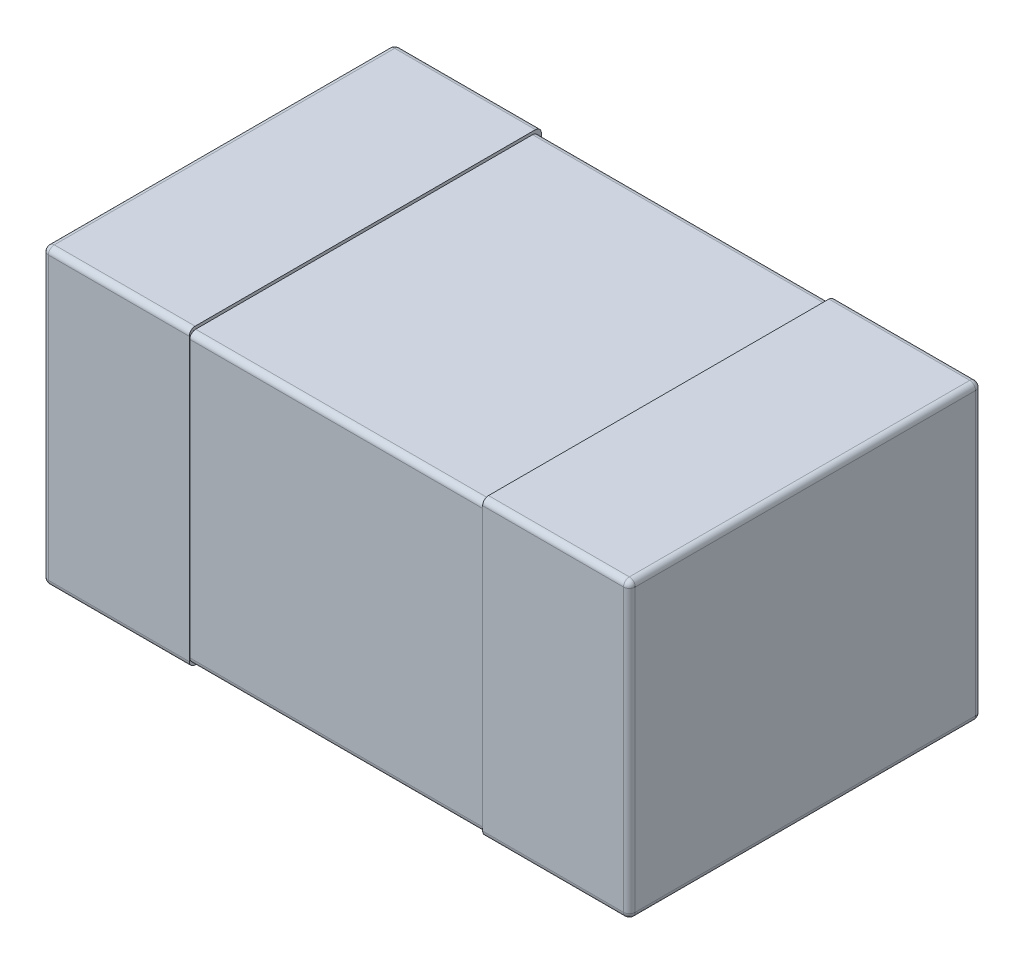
ISO-10303-21;
HEADER;
FILE_DESCRIPTION(('STEP AP214'),'2;1');
FILE_NAME('part.step','',(''),(''),'','','');
FILE_SCHEMA(('AUTOMOTIVE_DESIGN { 1 0 10303 214 1 1 1 1 }'));
ENDSEC;
DATA;
#1=APPLICATION_CONTEXT('core data for automotive mechanical design processes');
#2=APPLICATION_PROTOCOL_DEFINITION('international standard','automotive_design',2000,#1);
#3=PRODUCT_CONTEXT('',#1,'mechanical');
#4=PRODUCT('Part','Part','',(#3));
#5=PRODUCT_RELATED_PRODUCT_CATEGORY('part','',(#4));
#6=PRODUCT_DEFINITION_FORMATION('','',#4);
#7=PRODUCT_DEFINITION_CONTEXT('part definition',#1,'design');
#8=PRODUCT_DEFINITION('design','',#6,#7);
#9=PRODUCT_DEFINITION_SHAPE('','',#8);
#10=(LENGTH_UNIT() NAMED_UNIT(*) SI_UNIT(.MILLI.,.METRE.));
#11=(NAMED_UNIT(*) PLANE_ANGLE_UNIT() SI_UNIT($,.RADIAN.));
#12=(NAMED_UNIT(*) SI_UNIT($,.STERADIAN.) SOLID_ANGLE_UNIT());
#13=UNCERTAINTY_MEASURE_WITH_UNIT(LENGTH_MEASURE(1.E-05),#10,'distance_accuracy_value','');
#14=(GEOMETRIC_REPRESENTATION_CONTEXT(3) GLOBAL_UNCERTAINTY_ASSIGNED_CONTEXT((#13)) GLOBAL_UNIT_ASSIGNED_CONTEXT((#10,
#11,#12)) REPRESENTATION_CONTEXT('',''));
#15=CARTESIAN_POINT('',(0.,0.,0.));
#16=DIRECTION('',(0.,0.,1.));
#17=DIRECTION('',(1.,0.,0.));
#18=AXIS2_PLACEMENT_3D('',#15,#16,#17);
#19=CARTESIAN_POINT('',(0.5,-0.25,0.3));
#20=DIRECTION('',(1.,0.,0.));
#21=DIRECTION('',(0.,0.,-1.));
#22=AXIS2_PLACEMENT_3D('',#19,#20,#21);
#23=PLANE('',#22);
#24=DIRECTION('',(0.,1.,0.));
#25=VECTOR('',#24,1.);
#26=CARTESIAN_POINT('',(0.5,-0.25,0.59));
#27=LINE('',#26,#25);
#28=CARTESIAN_POINT('',(0.5,-0.24,0.59));
#29=VERTEX_POINT('',#28);
#30=CARTESIAN_POINT('',(0.5,0.24,0.59));
#31=VERTEX_POINT('',#30);
#32=EDGE_CURVE('E236',#29,#31,#27,.T.);
#33=ORIENTED_EDGE('',*,*,#32,.F.);
#34=DIRECTION('',(0.,0.,1.));
#35=VECTOR('',#34,1.);
#36=CARTESIAN_POINT('',(0.5,-0.24,0.3));
#37=LINE('',#36,#35);
#38=CARTESIAN_POINT('',(0.5,-0.24,0.00999999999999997));
#39=VERTEX_POINT('',#38);
#40=EDGE_CURVE('E452',#39,#29,#37,.T.);
#41=ORIENTED_EDGE('',*,*,#40,.F.);
#42=DIRECTION('',(0.,1.,0.));
#43=VECTOR('',#42,1.);
#44=CARTESIAN_POINT('',(0.5,-0.25,0.00999999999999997));
#45=LINE('',#44,#43);
#46=CARTESIAN_POINT('',(0.5,0.24,0.00999999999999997));
#47=VERTEX_POINT('',#46);
#48=EDGE_CURVE('E480',#47,#39,#45,.F.);
#49=ORIENTED_EDGE('',*,*,#48,.F.);
#50=DIRECTION('',(0.,0.,1.));
#51=VECTOR('',#50,1.);
#52=CARTESIAN_POINT('',(0.5,0.24,0.3));
#53=LINE('',#52,#51);
#54=EDGE_CURVE('E521',#31,#47,#53,.F.);
#55=ORIENTED_EDGE('',*,*,#54,.F.);
#56=EDGE_LOOP('',(#33,#41,#49,#55));
#57=FACE_BOUND('',#56,.T.);
#58=ADVANCED_FACE('F16',(#57),#23,.T.);
#59=CARTESIAN_POINT('',(-0.5,-0.25,0.3));
#60=DIRECTION('',(-1.,0.,0.));
#61=DIRECTION('',(0.,0.,1.));
#62=AXIS2_PLACEMENT_3D('',#59,#60,#61);
#63=PLANE('',#62);
#64=DIRECTION('',(0.,0.,-1.));
#65=VECTOR('',#64,1.);
#66=CARTESIAN_POINT('',(-0.5,0.24,0.3));
#67=LINE('',#66,#65);
#68=CARTESIAN_POINT('',(-0.5,0.24,0.0100000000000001));
#69=VERTEX_POINT('',#68);
#70=CARTESIAN_POINT('',(-0.5,0.24,0.59));
#71=VERTEX_POINT('',#70);
#72=EDGE_CURVE('E441',#69,#71,#67,.F.);
#73=ORIENTED_EDGE('',*,*,#72,.F.);
#74=DIRECTION('',(0.,1.,0.));
#75=VECTOR('',#74,1.);
#76=CARTESIAN_POINT('',(-0.5,-0.25,0.0100000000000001));
#77=LINE('',#76,#75);
#78=CARTESIAN_POINT('',(-0.5,-0.24,0.0100000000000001));
#79=VERTEX_POINT('',#78);
#80=EDGE_CURVE('E221',#79,#69,#77,.T.);
#81=ORIENTED_EDGE('',*,*,#80,.F.);
#82=DIRECTION('',(0.,0.,1.));
#83=VECTOR('',#82,1.);
#84=CARTESIAN_POINT('',(-0.5,-0.24,0.3));
#85=LINE('',#84,#83);
#86=CARTESIAN_POINT('',(-0.5,-0.24,0.59));
#87=VERTEX_POINT('',#86);
#88=EDGE_CURVE('E394',#87,#79,#85,.F.);
#89=ORIENTED_EDGE('',*,*,#88,.F.);
#90=DIRECTION('',(0.,1.,0.));
#91=VECTOR('',#90,1.);
#92=CARTESIAN_POINT('',(-0.5,-0.25,0.59));
#93=LINE('',#92,#91);
#94=EDGE_CURVE('E1283',#71,#87,#93,.F.);
#95=ORIENTED_EDGE('',*,*,#94,.F.);
#96=EDGE_LOOP('',(#73,#81,#89,#95));
#97=FACE_BOUND('',#96,.T.);
#98=ADVANCED_FACE('F261',(#97),#63,.T.);
#99=CARTESIAN_POINT('',(0.49,-0.24,0.59));
#100=DIRECTION('',(1.,0.,0.));
#101=DIRECTION('',(0.,1.,0.));
#102=AXIS2_PLACEMENT_3D('',#99,#100,#101);
#103=SPHERICAL_SURFACE('',#102,0.01);
#104=CARTESIAN_POINT('',(0.49,-0.24,0.59));
#105=DIRECTION('',(0.,0.,1.));
#106=DIRECTION('',(1.,0.,0.));
#107=AXIS2_PLACEMENT_3D('',#104,#105,#106);
#108=CIRCLE('',#107,0.01);
#109=CARTESIAN_POINT('',(0.49,-0.25,0.59));
#110=VERTEX_POINT('',#109);
#111=EDGE_CURVE('E233',#29,#110,#108,.F.);
#112=ORIENTED_EDGE('',*,*,#111,.F.);
#113=CARTESIAN_POINT('',(0.49,-0.24,0.59));
#114=DIRECTION('',(0.,1.,0.));
#115=DIRECTION('',(0.,0.,1.));
#116=AXIS2_PLACEMENT_3D('',#113,#114,#115);
#117=CIRCLE('',#116,0.01);
#118=CARTESIAN_POINT('',(0.49,-0.24,0.6));
#119=VERTEX_POINT('',#118);
#120=EDGE_CURVE('E231',#119,#29,#117,.T.);
#121=ORIENTED_EDGE('',*,*,#120,.F.);
#122=CARTESIAN_POINT('',(0.49,-0.24,0.59));
#123=DIRECTION('',(-1.,0.,0.));
#124=DIRECTION('',(0.,-1.,0.));
#125=AXIS2_PLACEMENT_3D('',#122,#123,#124);
#126=CIRCLE('',#125,0.01);
#127=EDGE_CURVE('E211',#110,#119,#126,.T.);
#128=ORIENTED_EDGE('',*,*,#127,.F.);
#129=EDGE_LOOP('',(#112,#121,#128));
#130=FACE_BOUND('',#129,.T.);
#131=ADVANCED_FACE('F232',(#130),#103,.T.);
#132=CARTESIAN_POINT('',(0.49,-0.25,0.59));
#133=DIRECTION('',(0.,1.,0.));
#134=DIRECTION('',(0.,0.,1.));
#135=AXIS2_PLACEMENT_3D('',#132,#133,#134);
#136=CYLINDRICAL_SURFACE('',#135,0.01);
#137=ORIENTED_EDGE('',*,*,#120,.T.);
#138=ORIENTED_EDGE('',*,*,#32,.T.);
#139=CARTESIAN_POINT('',(0.49,0.24,0.59));
#140=DIRECTION('',(0.,-1.,0.));
#141=DIRECTION('',(1.,0.,0.));
#142=AXIS2_PLACEMENT_3D('',#139,#140,#141);
#143=CIRCLE('',#142,0.01);
#144=CARTESIAN_POINT('',(0.49,0.24,0.6));
#145=VERTEX_POINT('',#144);
#146=EDGE_CURVE('E241',#145,#31,#143,.F.);
#147=ORIENTED_EDGE('',*,*,#146,.F.);
#148=DIRECTION('',(0.,1.,0.));
#149=VECTOR('',#148,1.);
#150=CARTESIAN_POINT('',(0.49,-0.25,0.6));
#151=LINE('',#150,#149);
#152=EDGE_CURVE('E227',#119,#145,#151,.T.);
#153=ORIENTED_EDGE('',*,*,#152,.F.);
#154=EDGE_LOOP('',(#137,#138,#147,#153));
#155=FACE_BOUND('',#154,.T.);
#156=ADVANCED_FACE('F239',(#155),#136,.T.);
#157=CARTESIAN_POINT('',(0.49,0.24,0.59));
#158=DIRECTION('',(1.,0.,0.));
#159=DIRECTION('',(0.,1.,0.));
#160=AXIS2_PLACEMENT_3D('',#157,#158,#159);
#161=SPHERICAL_SURFACE('',#160,0.01);
#162=ORIENTED_EDGE('',*,*,#146,.T.);
#163=CARTESIAN_POINT('',(0.49,0.24,0.59));
#164=DIRECTION('',(0.,0.,1.));
#165=DIRECTION('',(1.,0.,0.));
#166=AXIS2_PLACEMENT_3D('',#163,#164,#165);
#167=CIRCLE('',#166,0.01);
#168=CARTESIAN_POINT('',(0.49,0.25,0.59));
#169=VERTEX_POINT('',#168);
#170=EDGE_CURVE('E518',#169,#31,#167,.F.);
#171=ORIENTED_EDGE('',*,*,#170,.F.);
#172=CARTESIAN_POINT('',(0.49,0.24,0.59));
#173=DIRECTION('',(-1.,0.,0.));
#174=DIRECTION('',(0.,-1.,0.));
#175=AXIS2_PLACEMENT_3D('',#172,#173,#174);
#176=CIRCLE('',#175,0.01);
#177=EDGE_CURVE('E245',#145,#169,#176,.T.);
#178=ORIENTED_EDGE('',*,*,#177,.F.);
#179=EDGE_LOOP('',(#162,#171,#178));
#180=FACE_BOUND('',#179,.T.);
#181=ADVANCED_FACE('F509',(#180),#161,.T.);
#182=CARTESIAN_POINT('',(0.49,0.24,0.3));
#183=DIRECTION('',(0.,0.,1.));
#184=DIRECTION('',(1.,0.,0.));
#185=AXIS2_PLACEMENT_3D('',#182,#183,#184);
#186=CYLINDRICAL_SURFACE('',#185,0.01);
#187=CARTESIAN_POINT('',(0.49,0.24,0.00999999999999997));
#188=DIRECTION('',(0.,0.,1.));
#189=DIRECTION('',(1.,0.,0.));
#190=AXIS2_PLACEMENT_3D('',#187,#188,#189);
#191=CIRCLE('',#190,0.01);
#192=CARTESIAN_POINT('',(0.49,0.25,0.00999999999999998));
#193=VERTEX_POINT('',#192);
#194=EDGE_CURVE('E492',#193,#47,#191,.F.);
#195=ORIENTED_EDGE('',*,*,#194,.F.);
#196=DIRECTION('',(0.,0.,1.));
#197=VECTOR('',#196,1.);
#198=CARTESIAN_POINT('',(0.49,0.25,0.3));
#199=LINE('',#198,#197);
#200=EDGE_CURVE('E652',#169,#193,#199,.F.);
#201=ORIENTED_EDGE('',*,*,#200,.F.);
#202=ORIENTED_EDGE('',*,*,#170,.T.);
#203=ORIENTED_EDGE('',*,*,#54,.T.);
#204=EDGE_LOOP('',(#195,#201,#202,#203));
#205=FACE_BOUND('',#204,.T.);
#206=ADVANCED_FACE('F506',(#205),#186,.T.);
#207=CARTESIAN_POINT('',(0.49,0.24,0.00999999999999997));
#208=DIRECTION('',(1.,0.,0.));
#209=DIRECTION('',(0.,1.,0.));
#210=AXIS2_PLACEMENT_3D('',#207,#208,#209);
#211=SPHERICAL_SURFACE('',#210,0.01);
#212=CARTESIAN_POINT('',(0.49,0.24,0.00999999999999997));
#213=DIRECTION('',(0.,1.,0.));
#214=DIRECTION('',(0.,0.,1.));
#215=AXIS2_PLACEMENT_3D('',#212,#213,#214);
#216=CIRCLE('',#215,0.01);
#217=CARTESIAN_POINT('',(0.49,0.24,0.));
#218=VERTEX_POINT('',#217);
#219=EDGE_CURVE('E489',#218,#47,#216,.F.);
#220=ORIENTED_EDGE('',*,*,#219,.F.);
#221=CARTESIAN_POINT('',(0.49,0.24,0.00999999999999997));
#222=DIRECTION('',(1.,0.,0.));
#223=DIRECTION('',(0.,0.,-1.));
#224=AXIS2_PLACEMENT_3D('',#221,#222,#223);
#225=CIRCLE('',#224,0.01);
#226=EDGE_CURVE('E495',#193,#218,#225,.F.);
#227=ORIENTED_EDGE('',*,*,#226,.F.);
#228=ORIENTED_EDGE('',*,*,#194,.T.);
#229=EDGE_LOOP('',(#220,#227,#228));
#230=FACE_BOUND('',#229,.T.);
#231=ADVANCED_FACE('F503',(#230),#211,.T.);
#232=CARTESIAN_POINT('',(0.49,-0.25,0.00999999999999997));
#233=DIRECTION('',(0.,1.,0.));
#234=DIRECTION('',(0.,0.,1.));
#235=AXIS2_PLACEMENT_3D('',#232,#233,#234);
#236=CYLINDRICAL_SURFACE('',#235,0.01);
#237=CARTESIAN_POINT('',(0.49,-0.24,0.00999999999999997));
#238=DIRECTION('',(0.,1.,0.));
#239=DIRECTION('',(1.,0.,0.));
#240=AXIS2_PLACEMENT_3D('',#237,#238,#239);
#241=CIRCLE('',#240,0.01);
#242=CARTESIAN_POINT('',(0.49,-0.24,0.));
#243=VERTEX_POINT('',#242);
#244=EDGE_CURVE('E477',#243,#39,#241,.F.);
#245=ORIENTED_EDGE('',*,*,#244,.F.);
#246=DIRECTION('',(0.,1.,0.));
#247=VECTOR('',#246,1.);
#248=CARTESIAN_POINT('',(0.49,-0.25,0.));
#249=LINE('',#248,#247);
#250=EDGE_CURVE('E483',#218,#243,#249,.F.);
#251=ORIENTED_EDGE('',*,*,#250,.F.);
#252=ORIENTED_EDGE('',*,*,#219,.T.);
#253=ORIENTED_EDGE('',*,*,#48,.T.);
#254=EDGE_LOOP('',(#245,#251,#252,#253));
#255=FACE_BOUND('',#254,.T.);
#256=ADVANCED_FACE('F469',(#255),#236,.T.);
#257=CARTESIAN_POINT('',(0.49,-0.24,0.00999999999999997));
#258=DIRECTION('',(1.,0.,0.));
#259=DIRECTION('',(0.,1.,0.));
#260=AXIS2_PLACEMENT_3D('',#257,#258,#259);
#261=SPHERICAL_SURFACE('',#260,0.01);
#262=CARTESIAN_POINT('',(0.49,-0.24,0.00999999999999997));
#263=DIRECTION('',(1.,0.,0.));
#264=DIRECTION('',(0.,0.,-1.));
#265=AXIS2_PLACEMENT_3D('',#262,#263,#264);
#266=CIRCLE('',#265,0.01);
#267=CARTESIAN_POINT('',(0.49,-0.25,0.00999999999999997));
#268=VERTEX_POINT('',#267);
#269=EDGE_CURVE('E643',#243,#268,#266,.F.);
#270=ORIENTED_EDGE('',*,*,#269,.F.);
#271=ORIENTED_EDGE('',*,*,#244,.T.);
#272=CARTESIAN_POINT('',(0.49,-0.24,0.00999999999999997));
#273=DIRECTION('',(0.,0.,1.));
#274=DIRECTION('',(1.,0.,0.));
#275=AXIS2_PLACEMENT_3D('',#272,#273,#274);
#276=CIRCLE('',#275,0.01);
#277=EDGE_CURVE('E741',#268,#39,#276,.T.);
#278=ORIENTED_EDGE('',*,*,#277,.F.);
#279=EDGE_LOOP('',(#270,#271,#278));
#280=FACE_BOUND('',#279,.T.);
#281=ADVANCED_FACE('F464',(#280),#261,.T.);
#282=CARTESIAN_POINT('',(0.49,-0.24,0.3));
#283=DIRECTION('',(0.,0.,1.));
#284=DIRECTION('',(1.,0.,0.));
#285=AXIS2_PLACEMENT_3D('',#282,#283,#284);
#286=CYLINDRICAL_SURFACE('',#285,0.01);
#287=ORIENTED_EDGE('',*,*,#277,.T.);
#288=ORIENTED_EDGE('',*,*,#40,.T.);
#289=ORIENTED_EDGE('',*,*,#111,.T.);
#290=DIRECTION('',(0.,0.,1.));
#291=VECTOR('',#290,1.);
#292=CARTESIAN_POINT('',(0.49,-0.25,0.3));
#293=LINE('',#292,#291);
#294=EDGE_CURVE('E635',#110,#268,#293,.F.);
#295=ORIENTED_EDGE('',*,*,#294,.T.);
#296=EDGE_LOOP('',(#287,#288,#289,#295));
#297=FACE_BOUND('',#296,.T.);
#298=ADVANCED_FACE('F460',(#297),#286,.T.);
#299=CARTESIAN_POINT('',(-0.49,0.24,0.0100000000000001));
#300=DIRECTION('',(1.,0.,0.));
#301=DIRECTION('',(0.,1.,0.));
#302=AXIS2_PLACEMENT_3D('',#299,#300,#301);
#303=SPHERICAL_SURFACE('',#302,0.01);
#304=CARTESIAN_POINT('',(-0.49,0.24,0.0100000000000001));
#305=DIRECTION('',(0.,1.,0.));
#306=DIRECTION('',(0.,0.,1.));
#307=AXIS2_PLACEMENT_3D('',#304,#305,#306);
#308=CIRCLE('',#307,0.01);
#309=CARTESIAN_POINT('',(-0.49,0.24,0.));
#310=VERTEX_POINT('',#309);
#311=EDGE_CURVE('E393',#69,#310,#308,.F.);
#312=ORIENTED_EDGE('',*,*,#311,.F.);
#313=CARTESIAN_POINT('',(-0.49,0.24,0.0100000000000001));
#314=DIRECTION('',(0.,0.,-1.));
#315=DIRECTION('',(-1.,0.,0.));
#316=AXIS2_PLACEMENT_3D('',#313,#314,#315);
#317=CIRCLE('',#316,0.01);
#318=CARTESIAN_POINT('',(-0.49,0.25,0.0100000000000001));
#319=VERTEX_POINT('',#318);
#320=EDGE_CURVE('E450',#319,#69,#317,.F.);
#321=ORIENTED_EDGE('',*,*,#320,.F.);
#322=CARTESIAN_POINT('',(-0.49,0.24,0.0100000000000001));
#323=DIRECTION('',(1.,0.,0.));
#324=DIRECTION('',(0.,0.,-1.));
#325=AXIS2_PLACEMENT_3D('',#322,#323,#324);
#326=CIRCLE('',#325,0.01);
#327=EDGE_CURVE('E621',#310,#319,#326,.T.);
#328=ORIENTED_EDGE('',*,*,#327,.F.);
#329=EDGE_LOOP('',(#312,#321,#328));
#330=FACE_BOUND('',#329,.T.);
#331=ADVANCED_FACE('F457',(#330),#303,.T.);
#332=CARTESIAN_POINT('',(-0.49,0.24,0.3));
#333=DIRECTION('',(0.,0.,-1.));
#334=DIRECTION('',(-1.,0.,0.));
#335=AXIS2_PLACEMENT_3D('',#332,#333,#334);
#336=CYLINDRICAL_SURFACE('',#335,0.01);
#337=CARTESIAN_POINT('',(-0.49,0.24,0.59));
#338=DIRECTION('',(0.,0.,1.));
#339=DIRECTION('',(1.,0.,0.));
#340=AXIS2_PLACEMENT_3D('',#337,#338,#339);
#341=CIRCLE('',#340,0.01);
#342=CARTESIAN_POINT('',(-0.49,0.25,0.59));
#343=VERTEX_POINT('',#342);
#344=EDGE_CURVE('E437',#343,#71,#341,.T.);
#345=ORIENTED_EDGE('',*,*,#344,.F.);
#346=DIRECTION('',(0.,0.,1.));
#347=VECTOR('',#346,1.);
#348=CARTESIAN_POINT('',(-0.49,0.25,0.3));
#349=LINE('',#348,#347);
#350=EDGE_CURVE('E444',#319,#343,#349,.T.);
#351=ORIENTED_EDGE('',*,*,#350,.F.);
#352=ORIENTED_EDGE('',*,*,#320,.T.);
#353=ORIENTED_EDGE('',*,*,#72,.T.);
#354=EDGE_LOOP('',(#345,#351,#352,#353));
#355=FACE_BOUND('',#354,.T.);
#356=ADVANCED_FACE('F429',(#355),#336,.T.);
#357=CARTESIAN_POINT('',(-0.49,0.24,0.59));
#358=DIRECTION('',(1.,0.,0.));
#359=DIRECTION('',(0.,1.,0.));
#360=AXIS2_PLACEMENT_3D('',#357,#358,#359);
#361=SPHERICAL_SURFACE('',#360,0.01);
#362=CARTESIAN_POINT('',(-0.49,0.24,0.59));
#363=DIRECTION('',(0.,1.,0.));
#364=DIRECTION('',(0.,0.,1.));
#365=AXIS2_PLACEMENT_3D('',#362,#363,#364);
#366=CIRCLE('',#365,0.01);
#367=CARTESIAN_POINT('',(-0.49,0.24,0.6));
#368=VERTEX_POINT('',#367);
#369=EDGE_CURVE('E440',#368,#71,#366,.F.);
#370=ORIENTED_EDGE('',*,*,#369,.F.);
#371=CARTESIAN_POINT('',(-0.49,0.24,0.59));
#372=DIRECTION('',(-1.,0.,0.));
#373=DIRECTION('',(0.,-1.,0.));
#374=AXIS2_PLACEMENT_3D('',#371,#372,#373);
#375=CIRCLE('',#374,0.01);
#376=EDGE_CURVE('E612',#343,#368,#375,.F.);
#377=ORIENTED_EDGE('',*,*,#376,.F.);
#378=ORIENTED_EDGE('',*,*,#344,.T.);
#379=EDGE_LOOP('',(#370,#377,#378));
#380=FACE_BOUND('',#379,.T.);
#381=ADVANCED_FACE('F424',(#380),#361,.T.);
#382=CARTESIAN_POINT('',(-0.49,-0.25,0.59));
#383=DIRECTION('',(0.,1.,0.));
#384=DIRECTION('',(0.,0.,1.));
#385=AXIS2_PLACEMENT_3D('',#382,#383,#384);
#386=CYLINDRICAL_SURFACE('',#385,0.01);
#387=CARTESIAN_POINT('',(-0.49,-0.24,0.59));
#388=DIRECTION('',(0.,-1.,0.));
#389=DIRECTION('',(1.,0.,0.));
#390=AXIS2_PLACEMENT_3D('',#387,#388,#389);
#391=CIRCLE('',#390,0.01);
#392=CARTESIAN_POINT('',(-0.49,-0.24,0.6));
#393=VERTEX_POINT('',#392);
#394=EDGE_CURVE('E411',#393,#87,#391,.T.);
#395=ORIENTED_EDGE('',*,*,#394,.F.);
#396=DIRECTION('',(0.,1.,0.));
#397=VECTOR('',#396,1.);
#398=CARTESIAN_POINT('',(-0.49,-0.25,0.6));
#399=LINE('',#398,#397);
#400=EDGE_CURVE('E606',#368,#393,#399,.F.);
#401=ORIENTED_EDGE('',*,*,#400,.F.);
#402=ORIENTED_EDGE('',*,*,#369,.T.);
#403=ORIENTED_EDGE('',*,*,#94,.T.);
#404=EDGE_LOOP('',(#395,#401,#402,#403));
#405=FACE_BOUND('',#404,.T.);
#406=ADVANCED_FACE('F420',(#405),#386,.T.);
#407=CARTESIAN_POINT('',(-0.49,-0.24,0.59));
#408=DIRECTION('',(1.,0.,0.));
#409=DIRECTION('',(0.,1.,0.));
#410=AXIS2_PLACEMENT_3D('',#407,#408,#409);
#411=SPHERICAL_SURFACE('',#410,0.01);
#412=CARTESIAN_POINT('',(-0.49,-0.24,0.59));
#413=DIRECTION('',(0.,0.,1.));
#414=DIRECTION('',(1.,0.,0.));
#415=AXIS2_PLACEMENT_3D('',#412,#413,#414);
#416=CIRCLE('',#415,0.01);
#417=CARTESIAN_POINT('',(-0.49,-0.25,0.59));
#418=VERTEX_POINT('',#417);
#419=EDGE_CURVE('E408',#418,#87,#416,.F.);
#420=ORIENTED_EDGE('',*,*,#419,.F.);
#421=CARTESIAN_POINT('',(-0.49,-0.24,0.59));
#422=DIRECTION('',(1.,0.,0.));
#423=DIRECTION('',(0.,1.,0.));
#424=AXIS2_PLACEMENT_3D('',#421,#422,#423);
#425=CIRCLE('',#424,0.01);
#426=EDGE_CURVE('E401',#393,#418,#425,.T.);
#427=ORIENTED_EDGE('',*,*,#426,.F.);
#428=ORIENTED_EDGE('',*,*,#394,.T.);
#429=EDGE_LOOP('',(#420,#427,#428));
#430=FACE_BOUND('',#429,.T.);
#431=ADVANCED_FACE('F417',(#430),#411,.T.);
#432=CARTESIAN_POINT('',(-0.49,-0.24,0.3));
#433=DIRECTION('',(0.,0.,1.));
#434=DIRECTION('',(1.,0.,0.));
#435=AXIS2_PLACEMENT_3D('',#432,#433,#434);
#436=CYLINDRICAL_SURFACE('',#435,0.01);
#437=CARTESIAN_POINT('',(-0.49,-0.24,0.0100000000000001));
#438=DIRECTION('',(0.,0.,-1.));
#439=DIRECTION('',(1.,0.,0.));
#440=AXIS2_PLACEMENT_3D('',#437,#438,#439);
#441=CIRCLE('',#440,0.01);
#442=CARTESIAN_POINT('',(-0.49,-0.25,0.0100000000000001));
#443=VERTEX_POINT('',#442);
#444=EDGE_CURVE('E390',#443,#79,#441,.T.);
#445=ORIENTED_EDGE('',*,*,#444,.F.);
#446=DIRECTION('',(0.,0.,1.));
#447=VECTOR('',#446,1.);
#448=CARTESIAN_POINT('',(-0.49,-0.25,0.3));
#449=LINE('',#448,#447);
#450=EDGE_CURVE('E397',#443,#418,#449,.T.);
#451=ORIENTED_EDGE('',*,*,#450,.T.);
#452=ORIENTED_EDGE('',*,*,#419,.T.);
#453=ORIENTED_EDGE('',*,*,#88,.T.);
#454=EDGE_LOOP('',(#445,#451,#452,#453));
#455=FACE_BOUND('',#454,.T.);
#456=ADVANCED_FACE('F382',(#455),#436,.T.);
#457=CARTESIAN_POINT('',(-0.49,-0.24,0.0100000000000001));
#458=DIRECTION('',(1.,0.,0.));
#459=DIRECTION('',(0.,1.,0.));
#460=AXIS2_PLACEMENT_3D('',#457,#458,#459);
#461=SPHERICAL_SURFACE('',#460,0.01);
#462=CARTESIAN_POINT('',(-0.49,-0.24,0.0100000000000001));
#463=DIRECTION('',(-1.,0.,0.));
#464=DIRECTION('',(0.,0.,1.));
#465=AXIS2_PLACEMENT_3D('',#462,#463,#464);
#466=CIRCLE('',#465,0.01);
#467=CARTESIAN_POINT('',(-0.49,-0.24,0.));
#468=VERTEX_POINT('',#467);
#469=EDGE_CURVE('E138',#443,#468,#466,.F.);
#470=ORIENTED_EDGE('',*,*,#469,.F.);
#471=ORIENTED_EDGE('',*,*,#444,.T.);
#472=CARTESIAN_POINT('',(-0.49,-0.24,0.0100000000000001));
#473=DIRECTION('',(0.,1.,0.));
#474=DIRECTION('',(0.,0.,1.));
#475=AXIS2_PLACEMENT_3D('',#472,#473,#474);
#476=CIRCLE('',#475,0.01);
#477=EDGE_CURVE('E667',#468,#79,#476,.T.);
#478=ORIENTED_EDGE('',*,*,#477,.F.);
#479=EDGE_LOOP('',(#470,#471,#478));
#480=FACE_BOUND('',#479,.T.);
#481=ADVANCED_FACE('F377',(#480),#461,.T.);
#482=CARTESIAN_POINT('',(-0.49,-0.25,0.0100000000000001));
#483=DIRECTION('',(0.,1.,0.));
#484=DIRECTION('',(0.,0.,1.));
#485=AXIS2_PLACEMENT_3D('',#482,#483,#484);
#486=CYLINDRICAL_SURFACE('',#485,0.01);
#487=ORIENTED_EDGE('',*,*,#477,.T.);
#488=ORIENTED_EDGE('',*,*,#80,.T.);
#489=ORIENTED_EDGE('',*,*,#311,.T.);
#490=DIRECTION('',(0.,1.,0.));
#491=VECTOR('',#490,1.);
#492=CARTESIAN_POINT('',(-0.49,-0.25,0.));
#493=LINE('',#492,#491);
#494=EDGE_CURVE('E589',#468,#310,#493,.T.);
#495=ORIENTED_EDGE('',*,*,#494,.F.);
#496=EDGE_LOOP('',(#487,#488,#489,#495));
#497=FACE_BOUND('',#496,.T.);
#498=ADVANCED_FACE('F374',(#497),#486,.T.);
#499=CARTESIAN_POINT('',(0.375,-0.24,0.59));
#500=DIRECTION('',(-1.,0.,0.));
#501=DIRECTION('',(0.,-1.,0.));
#502=AXIS2_PLACEMENT_3D('',#499,#500,#501);
#503=CYLINDRICAL_SURFACE('',#502,0.01);
#504=ORIENTED_EDGE('',*,*,#127,.T.);
#505=DIRECTION('',(1.,0.,0.));
#506=VECTOR('',#505,1.);
#507=CARTESIAN_POINT('',(0.375,-0.24,0.6));
#508=LINE('',#507,#506);
#509=CARTESIAN_POINT('',(0.25,-0.24,0.6));
#510=VERTEX_POINT('',#509);
#511=EDGE_CURVE('E215',#510,#119,#508,.T.);
#512=ORIENTED_EDGE('',*,*,#511,.F.);
#513=CARTESIAN_POINT('',(0.25,-0.24,0.59));
#514=DIRECTION('',(-1.,0.,0.));
#515=DIRECTION('',(0.,-1.,0.));
#516=AXIS2_PLACEMENT_3D('',#513,#514,#515);
#517=CIRCLE('',#516,0.01);
#518=CARTESIAN_POINT('',(0.25,-0.25,0.59));
#519=VERTEX_POINT('',#518);
#520=EDGE_CURVE('E570',#519,#510,#517,.T.);
#521=ORIENTED_EDGE('',*,*,#520,.F.);
#522=DIRECTION('',(-1.,0.,0.));
#523=VECTOR('',#522,1.);
#524=CARTESIAN_POINT('',(0.375,-0.25,0.59));
#525=LINE('',#524,#523);
#526=EDGE_CURVE('E217',#519,#110,#525,.F.);
#527=ORIENTED_EDGE('',*,*,#526,.T.);
#528=EDGE_LOOP('',(#504,#512,#521,#527));
#529=FACE_BOUND('',#528,.T.);
#530=ADVANCED_FACE('F213',(#529),#503,.T.);
#531=CARTESIAN_POINT('',(0.375,-0.25,0.6));
#532=DIRECTION('',(0.,0.,1.));
#533=DIRECTION('',(1.,0.,0.));
#534=AXIS2_PLACEMENT_3D('',#531,#532,#533);
#535=PLANE('',#534);
#536=DIRECTION('',(-1.,0.,0.));
#537=VECTOR('',#536,1.);
#538=CARTESIAN_POINT('',(0.375,0.24,0.6));
#539=LINE('',#538,#537);
#540=CARTESIAN_POINT('',(0.25,0.24,0.6));
#541=VERTEX_POINT('',#540);
#542=EDGE_CURVE('E243',#541,#145,#539,.F.);
#543=ORIENTED_EDGE('',*,*,#542,.F.);
#544=DIRECTION('',(0.,1.,0.));
#545=VECTOR('',#544,1.);
#546=CARTESIAN_POINT('',(0.25,-0.25,0.6));
#547=LINE('',#546,#545);
#548=EDGE_CURVE('E229',#510,#541,#547,.T.);
#549=ORIENTED_EDGE('',*,*,#548,.F.);
#550=ORIENTED_EDGE('',*,*,#511,.T.);
#551=ORIENTED_EDGE('',*,*,#152,.T.);
#552=EDGE_LOOP('',(#543,#549,#550,#551));
#553=FACE_BOUND('',#552,.T.);
#554=ADVANCED_FACE('F225',(#553),#535,.T.);
#555=CARTESIAN_POINT('',(0.375,0.24,0.59));
#556=DIRECTION('',(-1.,0.,0.));
#557=DIRECTION('',(0.,-1.,0.));
#558=AXIS2_PLACEMENT_3D('',#555,#556,#557);
#559=CYLINDRICAL_SURFACE('',#558,0.01);
#560=ORIENTED_EDGE('',*,*,#177,.T.);
#561=DIRECTION('',(-1.,0.,0.));
#562=VECTOR('',#561,1.);
#563=CARTESIAN_POINT('',(0.375,0.25,0.59));
#564=LINE('',#563,#562);
#565=CARTESIAN_POINT('',(0.25,0.25,0.59));
#566=VERTEX_POINT('',#565);
#567=EDGE_CURVE('E655',#566,#169,#564,.F.);
#568=ORIENTED_EDGE('',*,*,#567,.F.);
#569=CARTESIAN_POINT('',(0.25,0.24,0.59));
#570=DIRECTION('',(-1.,0.,0.));
#571=DIRECTION('',(0.,-1.,0.));
#572=AXIS2_PLACEMENT_3D('',#569,#570,#571);
#573=CIRCLE('',#572,0.01);
#574=EDGE_CURVE('E568',#541,#566,#573,.T.);
#575=ORIENTED_EDGE('',*,*,#574,.F.);
#576=ORIENTED_EDGE('',*,*,#542,.T.);
#577=EDGE_LOOP('',(#560,#568,#575,#576));
#578=FACE_BOUND('',#577,.T.);
#579=ADVANCED_FACE('F365',(#578),#559,.T.);
#580=CARTESIAN_POINT('',(0.375,0.25,0.3));
#581=DIRECTION('',(0.,1.,0.));
#582=DIRECTION('',(-1.,0.,0.));
#583=AXIS2_PLACEMENT_3D('',#580,#581,#582);
#584=PLANE('',#583);
#585=DIRECTION('',(1.,0.,0.));
#586=VECTOR('',#585,1.);
#587=CARTESIAN_POINT('',(0.375,0.25,0.00999999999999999));
#588=LINE('',#587,#586);
#589=CARTESIAN_POINT('',(0.25,0.25,0.00999999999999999));
#590=VERTEX_POINT('',#589);
#591=EDGE_CURVE('E497',#590,#193,#588,.T.);
#592=ORIENTED_EDGE('',*,*,#591,.F.);
#593=DIRECTION('',(0.,0.,1.));
#594=VECTOR('',#593,1.);
#595=CARTESIAN_POINT('',(0.25,0.25,0.3));
#596=LINE('',#595,#594);
#597=EDGE_CURVE('E567',#566,#590,#596,.F.);
#598=ORIENTED_EDGE('',*,*,#597,.F.);
#599=ORIENTED_EDGE('',*,*,#567,.T.);
#600=ORIENTED_EDGE('',*,*,#200,.T.);
#601=EDGE_LOOP('',(#592,#598,#599,#600));
#602=FACE_BOUND('',#601,.T.);
#603=ADVANCED_FACE('F361',(#602),#584,.T.);
#604=CARTESIAN_POINT('',(0.375,0.24,0.00999999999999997));
#605=DIRECTION('',(1.,0.,0.));
#606=DIRECTION('',(0.,0.,-1.));
#607=AXIS2_PLACEMENT_3D('',#604,#605,#606);
#608=CYLINDRICAL_SURFACE('',#607,0.01);
#609=ORIENTED_EDGE('',*,*,#226,.T.);
#610=DIRECTION('',(-1.,0.,0.));
#611=VECTOR('',#610,1.);
#612=CARTESIAN_POINT('',(0.375,0.24,0.));
#613=LINE('',#612,#611);
#614=CARTESIAN_POINT('',(0.25,0.24,0.));
#615=VERTEX_POINT('',#614);
#616=EDGE_CURVE('E486',#615,#218,#613,.F.);
#617=ORIENTED_EDGE('',*,*,#616,.F.);
#618=CARTESIAN_POINT('',(0.25,0.24,0.00999999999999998));
#619=DIRECTION('',(1.,0.,0.));
#620=DIRECTION('',(0.,0.,-1.));
#621=AXIS2_PLACEMENT_3D('',#618,#619,#620);
#622=CIRCLE('',#621,0.01);
#623=EDGE_CURVE('E565',#590,#615,#622,.F.);
#624=ORIENTED_EDGE('',*,*,#623,.F.);
#625=ORIENTED_EDGE('',*,*,#591,.T.);
#626=EDGE_LOOP('',(#609,#617,#624,#625));
#627=FACE_BOUND('',#626,.T.);
#628=ADVANCED_FACE('F357',(#627),#608,.T.);
#629=CARTESIAN_POINT('',(0.375,-0.25,0.));
#630=DIRECTION('',(0.,0.,-1.));
#631=DIRECTION('',(-1.,0.,0.));
#632=AXIS2_PLACEMENT_3D('',#629,#630,#631);
#633=PLANE('',#632);
#634=ORIENTED_EDGE('',*,*,#616,.T.);
#635=ORIENTED_EDGE('',*,*,#250,.T.);
#636=DIRECTION('',(1.,0.,0.));
#637=VECTOR('',#636,1.);
#638=CARTESIAN_POINT('',(0.375,-0.24,0.));
#639=LINE('',#638,#637);
#640=CARTESIAN_POINT('',(0.25,-0.24,0.));
#641=VERTEX_POINT('',#640);
#642=EDGE_CURVE('E485',#641,#243,#639,.T.);
#643=ORIENTED_EDGE('',*,*,#642,.F.);
#644=DIRECTION('',(0.,1.,0.));
#645=VECTOR('',#644,1.);
#646=CARTESIAN_POINT('',(0.25,-0.25,0.));
#647=LINE('',#646,#645);
#648=EDGE_CURVE('E564',#615,#641,#647,.F.);
#649=ORIENTED_EDGE('',*,*,#648,.F.);
#650=EDGE_LOOP('',(#634,#635,#643,#649));
#651=FACE_BOUND('',#650,.T.);
#652=ADVANCED_FACE('F353',(#651),#633,.T.);
#653=CARTESIAN_POINT('',(0.375,-0.24,0.00999999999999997));
#654=DIRECTION('',(1.,0.,0.));
#655=DIRECTION('',(0.,0.,-1.));
#656=AXIS2_PLACEMENT_3D('',#653,#654,#655);
#657=CYLINDRICAL_SURFACE('',#656,0.01);
#658=ORIENTED_EDGE('',*,*,#269,.T.);
#659=DIRECTION('',(-1.,0.,0.));
#660=VECTOR('',#659,1.);
#661=CARTESIAN_POINT('',(0.375,-0.25,0.00999999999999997));
#662=LINE('',#661,#660);
#663=CARTESIAN_POINT('',(0.25,-0.25,0.00999999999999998));
#664=VERTEX_POINT('',#663);
#665=EDGE_CURVE('E632',#268,#664,#662,.T.);
#666=ORIENTED_EDGE('',*,*,#665,.T.);
#667=CARTESIAN_POINT('',(0.25,-0.24,0.00999999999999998));
#668=DIRECTION('',(1.,0.,0.));
#669=DIRECTION('',(0.,0.,-1.));
#670=AXIS2_PLACEMENT_3D('',#667,#668,#669);
#671=CIRCLE('',#670,0.01);
#672=EDGE_CURVE('E561',#641,#664,#671,.F.);
#673=ORIENTED_EDGE('',*,*,#672,.F.);
#674=ORIENTED_EDGE('',*,*,#642,.T.);
#675=EDGE_LOOP('',(#658,#666,#673,#674));
#676=FACE_BOUND('',#675,.T.);
#677=ADVANCED_FACE('F349',(#676),#657,.T.);
#678=CARTESIAN_POINT('',(0.375,-0.25,0.3));
#679=DIRECTION('',(0.,1.,0.));
#680=DIRECTION('',(-1.,0.,0.));
#681=AXIS2_PLACEMENT_3D('',#678,#679,#680);
#682=PLANE('',#681);
#683=DIRECTION('',(0.,0.,1.));
#684=VECTOR('',#683,1.);
#685=CARTESIAN_POINT('',(0.25,-0.25,0.3));
#686=LINE('',#685,#684);
#687=EDGE_CURVE('E563',#664,#519,#686,.T.);
#688=ORIENTED_EDGE('',*,*,#687,.F.);
#689=ORIENTED_EDGE('',*,*,#665,.F.);
#690=ORIENTED_EDGE('',*,*,#294,.F.);
#691=ORIENTED_EDGE('',*,*,#526,.F.);
#692=EDGE_LOOP('',(#688,#689,#690,#691));
#693=FACE_BOUND('',#692,.T.);
#694=ADVANCED_FACE('F345',(#693),#682,.F.);
#695=CARTESIAN_POINT('',(0.,0.235,0.589));
#696=DIRECTION('',(-1.,0.,0.));
#697=DIRECTION('',(0.,-1.,0.));
#698=AXIS2_PLACEMENT_3D('',#695,#696,#697);
#699=CYLINDRICAL_SURFACE('',#698,0.01);
#700=CARTESIAN_POINT('',(-0.25,0.235,0.589));
#701=DIRECTION('',(-1.,0.,0.));
#702=DIRECTION('',(0.,-1.,0.));
#703=AXIS2_PLACEMENT_3D('',#700,#701,#702);
#704=CIRCLE('',#703,0.01);
#705=CARTESIAN_POINT('',(-0.25,0.235,0.599));
#706=VERTEX_POINT('',#705);
#707=CARTESIAN_POINT('',(-0.25,0.245,0.589));
#708=VERTEX_POINT('',#707);
#709=EDGE_CURVE('E555',#706,#708,#704,.T.);
#710=ORIENTED_EDGE('',*,*,#709,.F.);
#711=DIRECTION('',(1.,0.,0.));
#712=VECTOR('',#711,1.);
#713=CARTESIAN_POINT('',(0.,0.235,0.599));
#714=LINE('',#713,#712);
#715=CARTESIAN_POINT('',(0.25,0.235,0.599));
#716=VERTEX_POINT('',#715);
#717=EDGE_CURVE('E630',#716,#706,#714,.F.);
#718=ORIENTED_EDGE('',*,*,#717,.F.);
#719=CARTESIAN_POINT('',(0.25,0.235,0.589));
#720=DIRECTION('',(-1.,0.,0.));
#721=DIRECTION('',(0.,-1.,0.));
#722=AXIS2_PLACEMENT_3D('',#719,#720,#721);
#723=CIRCLE('',#722,0.01);
#724=CARTESIAN_POINT('',(0.25,0.245,0.589));
#725=VERTEX_POINT('',#724);
#726=EDGE_CURVE('E19',#725,#716,#723,.F.);
#727=ORIENTED_EDGE('',*,*,#726,.F.);
#728=DIRECTION('',(1.,0.,0.));
#729=VECTOR('',#728,1.);
#730=CARTESIAN_POINT('',(0.,0.245,0.589));
#731=LINE('',#730,#729);
#732=EDGE_CURVE('E128',#708,#725,#731,.T.);
#733=ORIENTED_EDGE('',*,*,#732,.F.);
#734=EDGE_LOOP('',(#710,#718,#727,#733));
#735=FACE_BOUND('',#734,.T.);
#736=ADVANCED_FACE('F342',(#735),#699,.T.);
#737=CARTESIAN_POINT('',(0.,0.245,0.302));
#738=DIRECTION('',(0.,1.,0.));
#739=DIRECTION('',(0.,0.,1.));
#740=AXIS2_PLACEMENT_3D('',#737,#738,#739);
#741=PLANE('',#740);
#742=DIRECTION('',(1.,0.,0.));
#743=VECTOR('',#742,1.);
#744=CARTESIAN_POINT('',(0.,0.245,0.0149999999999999));
#745=LINE('',#744,#743);
#746=CARTESIAN_POINT('',(-0.25,0.245,0.0149999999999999));
#747=VERTEX_POINT('',#746);
#748=CARTESIAN_POINT('',(0.25,0.245,0.0149999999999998));
#749=VERTEX_POINT('',#748);
#750=EDGE_CURVE('E627',#747,#749,#745,.T.);
#751=ORIENTED_EDGE('',*,*,#750,.F.);
#752=DIRECTION('',(0.,0.,-1.));
#753=VECTOR('',#752,1.);
#754=CARTESIAN_POINT('',(-0.25,0.245,0.3));
#755=LINE('',#754,#753);
#756=EDGE_CURVE('E554',#708,#747,#755,.T.);
#757=ORIENTED_EDGE('',*,*,#756,.F.);
#758=ORIENTED_EDGE('',*,*,#732,.T.);
#759=DIRECTION('',(0.,0.,1.));
#760=VECTOR('',#759,1.);
#761=CARTESIAN_POINT('',(0.25,0.245,0.3));
#762=LINE('',#761,#760);
#763=EDGE_CURVE('E571',#749,#725,#762,.T.);
#764=ORIENTED_EDGE('',*,*,#763,.F.);
#765=EDGE_LOOP('',(#751,#757,#758,#764));
#766=FACE_BOUND('',#765,.T.);
#767=ADVANCED_FACE('F338',(#766),#741,.T.);
#768=CARTESIAN_POINT('',(0.,0.235,0.0149999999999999));
#769=DIRECTION('',(1.,0.,0.));
#770=DIRECTION('',(0.,0.,-1.));
#771=AXIS2_PLACEMENT_3D('',#768,#769,#770);
#772=CYLINDRICAL_SURFACE('',#771,0.01);
#773=CARTESIAN_POINT('',(0.25,0.235,0.0149999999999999));
#774=DIRECTION('',(1.,0.,0.));
#775=DIRECTION('',(0.,0.,-1.));
#776=AXIS2_PLACEMENT_3D('',#773,#774,#775);
#777=CIRCLE('',#776,0.01);
#778=CARTESIAN_POINT('',(0.25,0.235,0.00499999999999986));
#779=VERTEX_POINT('',#778);
#780=EDGE_CURVE('E572',#779,#749,#777,.T.);
#781=ORIENTED_EDGE('',*,*,#780,.F.);
#782=DIRECTION('',(-1.,0.,0.));
#783=VECTOR('',#782,1.);
#784=CARTESIAN_POINT('',(0.,0.235,0.0049999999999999));
#785=LINE('',#784,#783);
#786=CARTESIAN_POINT('',(-0.25,0.235,0.00499999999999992));
#787=VERTEX_POINT('',#786);
#788=EDGE_CURVE('E625',#787,#779,#785,.F.);
#789=ORIENTED_EDGE('',*,*,#788,.F.);
#790=CARTESIAN_POINT('',(-0.25,0.235,0.0149999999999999));
#791=DIRECTION('',(1.,0.,0.));
#792=DIRECTION('',(0.,0.,-1.));
#793=AXIS2_PLACEMENT_3D('',#790,#791,#792);
#794=CIRCLE('',#793,0.01);
#795=EDGE_CURVE('E552',#747,#787,#794,.F.);
#796=ORIENTED_EDGE('',*,*,#795,.F.);
#797=ORIENTED_EDGE('',*,*,#750,.T.);
#798=EDGE_LOOP('',(#781,#789,#796,#797));
#799=FACE_BOUND('',#798,.T.);
#800=ADVANCED_FACE('F334',(#799),#772,.T.);
#801=CARTESIAN_POINT('',(0.,-0.245,0.0049999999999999));
#802=DIRECTION('',(0.,0.,-1.));
#803=DIRECTION('',(-1.,0.,0.));
#804=AXIS2_PLACEMENT_3D('',#801,#802,#803);
#805=PLANE('',#804);
#806=DIRECTION('',(1.,0.,0.));
#807=VECTOR('',#806,1.);
#808=CARTESIAN_POINT('',(0.,-0.235,0.0049999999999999));
#809=LINE('',#808,#807);
#810=CARTESIAN_POINT('',(-0.25,-0.235,0.00499999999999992));
#811=VERTEX_POINT('',#810);
#812=CARTESIAN_POINT('',(0.25,-0.235,0.00499999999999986));
#813=VERTEX_POINT('',#812);
#814=EDGE_CURVE('E560',#811,#813,#809,.T.);
#815=ORIENTED_EDGE('',*,*,#814,.F.);
#816=DIRECTION('',(0.,1.,0.));
#817=VECTOR('',#816,1.);
#818=CARTESIAN_POINT('',(-0.25,-0.25,0.0049999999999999));
#819=LINE('',#818,#817);
#820=EDGE_CURVE('E551',#787,#811,#819,.F.);
#821=ORIENTED_EDGE('',*,*,#820,.F.);
#822=ORIENTED_EDGE('',*,*,#788,.T.);
#823=DIRECTION('',(0.,1.,0.));
#824=VECTOR('',#823,1.);
#825=CARTESIAN_POINT('',(0.25,-0.25,0.00499999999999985));
#826=LINE('',#825,#824);
#827=EDGE_CURVE('E574',#813,#779,#826,.T.);
#828=ORIENTED_EDGE('',*,*,#827,.F.);
#829=EDGE_LOOP('',(#815,#821,#822,#828));
#830=FACE_BOUND('',#829,.T.);
#831=ADVANCED_FACE('F330',(#830),#805,.T.);
#832=CARTESIAN_POINT('',(-0.375,0.24,0.0100000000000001));
#833=DIRECTION('',(1.,0.,0.));
#834=DIRECTION('',(0.,0.,-1.));
#835=AXIS2_PLACEMENT_3D('',#832,#833,#834);
#836=CYLINDRICAL_SURFACE('',#835,0.01);
#837=ORIENTED_EDGE('',*,*,#327,.T.);
#838=DIRECTION('',(-1.,0.,0.));
#839=VECTOR('',#838,1.);
#840=CARTESIAN_POINT('',(-0.375,0.25,0.0100000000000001));
#841=LINE('',#840,#839);
#842=CARTESIAN_POINT('',(-0.25,0.25,0.0100000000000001));
#843=VERTEX_POINT('',#842);
#844=EDGE_CURVE('E447',#843,#319,#841,.T.);
#845=ORIENTED_EDGE('',*,*,#844,.F.);
#846=CARTESIAN_POINT('',(-0.25,0.24,0.0100000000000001));
#847=DIRECTION('',(1.,0.,0.));
#848=DIRECTION('',(0.,0.,-1.));
#849=AXIS2_PLACEMENT_3D('',#846,#847,#848);
#850=CIRCLE('',#849,0.01);
#851=CARTESIAN_POINT('',(-0.25,0.24,0.));
#852=VERTEX_POINT('',#851);
#853=EDGE_CURVE('E547',#852,#843,#850,.T.);
#854=ORIENTED_EDGE('',*,*,#853,.F.);
#855=DIRECTION('',(-1.,0.,0.));
#856=VECTOR('',#855,1.);
#857=CARTESIAN_POINT('',(-0.375,0.24,0.));
#858=LINE('',#857,#856);
#859=EDGE_CURVE('E590',#310,#852,#858,.F.);
#860=ORIENTED_EDGE('',*,*,#859,.F.);
#861=EDGE_LOOP('',(#837,#845,#854,#860));
#862=FACE_BOUND('',#861,.T.);
#863=ADVANCED_FACE('F326',(#862),#836,.T.);
#864=CARTESIAN_POINT('',(-0.375,0.25,0.3));
#865=DIRECTION('',(0.,1.,0.));
#866=DIRECTION('',(-1.,0.,0.));
#867=AXIS2_PLACEMENT_3D('',#864,#865,#866);
#868=PLANE('',#867);
#869=DIRECTION('',(-1.,0.,0.));
#870=VECTOR('',#869,1.);
#871=CARTESIAN_POINT('',(-0.375,0.25,0.59));
#872=LINE('',#871,#870);
#873=CARTESIAN_POINT('',(-0.25,0.25,0.59));
#874=VERTEX_POINT('',#873);
#875=EDGE_CURVE('E446',#874,#343,#872,.T.);
#876=ORIENTED_EDGE('',*,*,#875,.F.);
#877=DIRECTION('',(0.,0.,-1.));
#878=VECTOR('',#877,1.);
#879=CARTESIAN_POINT('',(-0.25,0.25,0.3));
#880=LINE('',#879,#878);
#881=EDGE_CURVE('E546',#843,#874,#880,.F.);
#882=ORIENTED_EDGE('',*,*,#881,.F.);
#883=ORIENTED_EDGE('',*,*,#844,.T.);
#884=ORIENTED_EDGE('',*,*,#350,.T.);
#885=EDGE_LOOP('',(#876,#882,#883,#884));
#886=FACE_BOUND('',#885,.T.);
#887=ADVANCED_FACE('F322',(#886),#868,.T.);
#888=CARTESIAN_POINT('',(-0.375,0.24,0.59));
#889=DIRECTION('',(-1.,0.,0.));
#890=DIRECTION('',(0.,-1.,0.));
#891=AXIS2_PLACEMENT_3D('',#888,#889,#890);
#892=CYLINDRICAL_SURFACE('',#891,0.01);
#893=ORIENTED_EDGE('',*,*,#376,.T.);
#894=DIRECTION('',(1.,0.,0.));
#895=VECTOR('',#894,1.);
#896=CARTESIAN_POINT('',(-0.375,0.24,0.6));
#897=LINE('',#896,#895);
#898=CARTESIAN_POINT('',(-0.25,0.24,0.6));
#899=VERTEX_POINT('',#898);
#900=EDGE_CURVE('E609',#899,#368,#897,.F.);
#901=ORIENTED_EDGE('',*,*,#900,.F.);
#902=CARTESIAN_POINT('',(-0.25,0.24,0.59));
#903=DIRECTION('',(-1.,0.,0.));
#904=DIRECTION('',(0.,-1.,0.));
#905=AXIS2_PLACEMENT_3D('',#902,#903,#904);
#906=CIRCLE('',#905,0.01);
#907=EDGE_CURVE('E544',#874,#899,#906,.F.);
#908=ORIENTED_EDGE('',*,*,#907,.F.);
#909=ORIENTED_EDGE('',*,*,#875,.T.);
#910=EDGE_LOOP('',(#893,#901,#908,#909));
#911=FACE_BOUND('',#910,.T.);
#912=ADVANCED_FACE('F318',(#911),#892,.T.);
#913=CARTESIAN_POINT('',(-0.375,-0.25,0.6));
#914=DIRECTION('',(0.,0.,1.));
#915=DIRECTION('',(1.,0.,0.));
#916=AXIS2_PLACEMENT_3D('',#913,#914,#915);
#917=PLANE('',#916);
#918=DIRECTION('',(1.,0.,0.));
#919=VECTOR('',#918,1.);
#920=CARTESIAN_POINT('',(-0.375,-0.24,0.6));
#921=LINE('',#920,#919);
#922=CARTESIAN_POINT('',(-0.25,-0.24,0.6));
#923=VERTEX_POINT('',#922);
#924=EDGE_CURVE('E405',#923,#393,#921,.F.);
#925=ORIENTED_EDGE('',*,*,#924,.F.);
#926=DIRECTION('',(0.,1.,0.));
#927=VECTOR('',#926,1.);
#928=CARTESIAN_POINT('',(-0.25,-0.25,0.6));
#929=LINE('',#928,#927);
#930=EDGE_CURVE('E543',#899,#923,#929,.F.);
#931=ORIENTED_EDGE('',*,*,#930,.F.);
#932=ORIENTED_EDGE('',*,*,#900,.T.);
#933=ORIENTED_EDGE('',*,*,#400,.T.);
#934=EDGE_LOOP('',(#925,#931,#932,#933));
#935=FACE_BOUND('',#934,.T.);
#936=ADVANCED_FACE('F314',(#935),#917,.T.);
#937=CARTESIAN_POINT('',(-0.375,-0.24,0.59));
#938=DIRECTION('',(1.,0.,0.));
#939=DIRECTION('',(0.,1.,0.));
#940=AXIS2_PLACEMENT_3D('',#937,#938,#939);
#941=CYLINDRICAL_SURFACE('',#940,0.01);
#942=ORIENTED_EDGE('',*,*,#426,.T.);
#943=DIRECTION('',(-1.,0.,0.));
#944=VECTOR('',#943,1.);
#945=CARTESIAN_POINT('',(-0.375,-0.25,0.59));
#946=LINE('',#945,#944);
#947=CARTESIAN_POINT('',(-0.25,-0.25,0.59));
#948=VERTEX_POINT('',#947);
#949=EDGE_CURVE('E400',#418,#948,#946,.F.);
#950=ORIENTED_EDGE('',*,*,#949,.T.);
#951=CARTESIAN_POINT('',(-0.25,-0.24,0.59));
#952=DIRECTION('',(1.,0.,0.));
#953=DIRECTION('',(0.,1.,0.));
#954=AXIS2_PLACEMENT_3D('',#951,#952,#953);
#955=CIRCLE('',#954,0.01);
#956=EDGE_CURVE('E541',#923,#948,#955,.T.);
#957=ORIENTED_EDGE('',*,*,#956,.F.);
#958=ORIENTED_EDGE('',*,*,#924,.T.);
#959=EDGE_LOOP('',(#942,#950,#957,#958));
#960=FACE_BOUND('',#959,.T.);
#961=ADVANCED_FACE('F310',(#960),#941,.T.);
#962=CARTESIAN_POINT('',(-0.375,-0.25,0.3));
#963=DIRECTION('',(0.,1.,0.));
#964=DIRECTION('',(-1.,0.,0.));
#965=AXIS2_PLACEMENT_3D('',#962,#963,#964);
#966=PLANE('',#965);
#967=DIRECTION('',(0.,0.,-1.));
#968=VECTOR('',#967,1.);
#969=CARTESIAN_POINT('',(-0.25,-0.25,0.3));
#970=LINE('',#969,#968);
#971=CARTESIAN_POINT('',(-0.25,-0.25,0.0100000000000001));
#972=VERTEX_POINT('',#971);
#973=EDGE_CURVE('E540',#948,#972,#970,.T.);
#974=ORIENTED_EDGE('',*,*,#973,.F.);
#975=ORIENTED_EDGE('',*,*,#949,.F.);
#976=ORIENTED_EDGE('',*,*,#450,.F.);
#977=DIRECTION('',(-1.,0.,0.));
#978=VECTOR('',#977,1.);
#979=CARTESIAN_POINT('',(-0.375,-0.25,0.0100000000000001));
#980=LINE('',#979,#978);
#981=EDGE_CURVE('E596',#972,#443,#980,.T.);
#982=ORIENTED_EDGE('',*,*,#981,.F.);
#983=EDGE_LOOP('',(#974,#975,#976,#982));
#984=FACE_BOUND('',#983,.T.);
#985=ADVANCED_FACE('F307',(#984),#966,.F.);
#986=CARTESIAN_POINT('',(-0.375,-0.24,0.0100000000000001));
#987=DIRECTION('',(-1.,0.,0.));
#988=DIRECTION('',(0.,0.,1.));
#989=AXIS2_PLACEMENT_3D('',#986,#987,#988);
#990=CYLINDRICAL_SURFACE('',#989,0.01);
#991=ORIENTED_EDGE('',*,*,#469,.T.);
#992=DIRECTION('',(-1.,0.,0.));
#993=VECTOR('',#992,1.);
#994=CARTESIAN_POINT('',(-0.375,-0.24,0.));
#995=LINE('',#994,#993);
#996=CARTESIAN_POINT('',(-0.25,-0.24,0.));
#997=VERTEX_POINT('',#996);
#998=EDGE_CURVE('E587',#997,#468,#995,.T.);
#999=ORIENTED_EDGE('',*,*,#998,.F.);
#1000=CARTESIAN_POINT('',(-0.25,-0.24,0.0100000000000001));
#1001=DIRECTION('',(-1.,0.,0.));
#1002=DIRECTION('',(0.,0.,1.));
#1003=AXIS2_PLACEMENT_3D('',#1000,#1001,#1002);
#1004=CIRCLE('',#1003,0.01);
#1005=EDGE_CURVE('E538',#972,#997,#1004,.F.);
#1006=ORIENTED_EDGE('',*,*,#1005,.F.);
#1007=ORIENTED_EDGE('',*,*,#981,.T.);
#1008=EDGE_LOOP('',(#991,#999,#1006,#1007));
#1009=FACE_BOUND('',#1008,.T.);
#1010=ADVANCED_FACE('F303',(#1009),#990,.T.);
#1011=CARTESIAN_POINT('',(-0.375,-0.25,0.));
#1012=DIRECTION('',(0.,0.,-1.));
#1013=DIRECTION('',(-1.,0.,0.));
#1014=AXIS2_PLACEMENT_3D('',#1011,#1012,#1013);
#1015=PLANE('',#1014);
#1016=ORIENTED_EDGE('',*,*,#998,.T.);
#1017=ORIENTED_EDGE('',*,*,#494,.T.);
#1018=ORIENTED_EDGE('',*,*,#859,.T.);
#1019=DIRECTION('',(0.,1.,0.));
#1020=VECTOR('',#1019,1.);
#1021=CARTESIAN_POINT('',(-0.25,-0.25,0.));
#1022=LINE('',#1021,#1020);
#1023=EDGE_CURVE('E537',#997,#852,#1022,.T.);
#1024=ORIENTED_EDGE('',*,*,#1023,.F.);
#1025=EDGE_LOOP('',(#1016,#1017,#1018,#1024));
#1026=FACE_BOUND('',#1025,.T.);
#1027=ADVANCED_FACE('F299',(#1026),#1015,.T.);
#1028=CARTESIAN_POINT('',(0.,-0.245,0.599));
#1029=DIRECTION('',(0.,0.,1.));
#1030=DIRECTION('',(1.,0.,0.));
#1031=AXIS2_PLACEMENT_3D('',#1028,#1029,#1030);
#1032=PLANE('',#1031);
#1033=ORIENTED_EDGE('',*,*,#717,.T.);
#1034=DIRECTION('',(0.,1.,0.));
#1035=VECTOR('',#1034,1.);
#1036=CARTESIAN_POINT('',(-0.25,-0.25,0.599));
#1037=LINE('',#1036,#1035);
#1038=CARTESIAN_POINT('',(-0.25,-0.235,0.599));
#1039=VERTEX_POINT('',#1038);
#1040=EDGE_CURVE('E557',#1039,#706,#1037,.T.);
#1041=ORIENTED_EDGE('',*,*,#1040,.F.);
#1042=DIRECTION('',(-1.,0.,0.));
#1043=VECTOR('',#1042,1.);
#1044=CARTESIAN_POINT('',(0.,-0.235,0.599));
#1045=LINE('',#1044,#1043);
#1046=CARTESIAN_POINT('',(0.25,-0.235,0.599));
#1047=VERTEX_POINT('',#1046);
#1048=EDGE_CURVE('E533',#1047,#1039,#1045,.T.);
#1049=ORIENTED_EDGE('',*,*,#1048,.F.);
#1050=DIRECTION('',(0.,1.,0.));
#1051=VECTOR('',#1050,1.);
#1052=CARTESIAN_POINT('',(0.25,-0.25,0.599));
#1053=LINE('',#1052,#1051);
#1054=EDGE_CURVE('E579',#716,#1047,#1053,.F.);
#1055=ORIENTED_EDGE('',*,*,#1054,.F.);
#1056=EDGE_LOOP('',(#1033,#1041,#1049,#1055));
#1057=FACE_BOUND('',#1056,.T.);
#1058=ADVANCED_FACE('F295',(#1057),#1032,.T.);
#1059=CARTESIAN_POINT('',(0.25,-0.25,0.3));
#1060=DIRECTION('',(-1.,0.,0.));
#1061=DIRECTION('',(0.,0.,1.));
#1062=AXIS2_PLACEMENT_3D('',#1059,#1060,#1061);
#1063=PLANE('',#1062);
#1064=ORIENTED_EDGE('',*,*,#672,.T.);
#1065=ORIENTED_EDGE('',*,*,#687,.T.);
#1066=ORIENTED_EDGE('',*,*,#520,.T.);
#1067=ORIENTED_EDGE('',*,*,#548,.T.);
#1068=ORIENTED_EDGE('',*,*,#574,.T.);
#1069=ORIENTED_EDGE('',*,*,#597,.T.);
#1070=ORIENTED_EDGE('',*,*,#623,.T.);
#1071=ORIENTED_EDGE('',*,*,#648,.T.);
#1072=EDGE_LOOP('',(#1064,#1065,#1066,#1067,#1068,#1069,#1070,#1071));
#1073=FACE_BOUND('',#1072,.T.);
#1074=ORIENTED_EDGE('',*,*,#780,.T.);
#1075=ORIENTED_EDGE('',*,*,#763,.T.);
#1076=ORIENTED_EDGE('',*,*,#726,.T.);
#1077=ORIENTED_EDGE('',*,*,#1054,.T.);
#1078=CARTESIAN_POINT('',(0.25,-0.235,0.589));
#1079=DIRECTION('',(-1.,0.,0.));
#1080=DIRECTION('',(0.,-1.,0.));
#1081=AXIS2_PLACEMENT_3D('',#1078,#1079,#1080);
#1082=CIRCLE('',#1081,0.01);
#1083=CARTESIAN_POINT('',(0.25,-0.245,0.589));
#1084=VERTEX_POINT('',#1083);
#1085=EDGE_CURVE('E534',#1084,#1047,#1082,.T.);
#1086=ORIENTED_EDGE('',*,*,#1085,.F.);
#1087=DIRECTION('',(0.,0.,1.));
#1088=VECTOR('',#1087,1.);
#1089=CARTESIAN_POINT('',(0.25,-0.245,0.302));
#1090=LINE('',#1089,#1088);
#1091=CARTESIAN_POINT('',(0.25,-0.245,0.0149999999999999));
#1092=VERTEX_POINT('',#1091);
#1093=EDGE_CURVE('E532',#1084,#1092,#1090,.F.);
#1094=ORIENTED_EDGE('',*,*,#1093,.T.);
#1095=CARTESIAN_POINT('',(0.25,-0.235,0.0149999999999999));
#1096=DIRECTION('',(1.,0.,0.));
#1097=DIRECTION('',(0.,0.,-1.));
#1098=AXIS2_PLACEMENT_3D('',#1095,#1096,#1097);
#1099=CIRCLE('',#1098,0.01);
#1100=EDGE_CURVE('E558',#813,#1092,#1099,.F.);
#1101=ORIENTED_EDGE('',*,*,#1100,.F.);
#1102=ORIENTED_EDGE('',*,*,#827,.T.);
#1103=EDGE_LOOP('',(#1074,#1075,#1076,#1077,#1086,#1094,#1101,#1102));
#1104=FACE_BOUND('',#1103,.T.);
#1105=ADVANCED_FACE('F291',(#1073,#1104),#1063,.T.);
#1106=CARTESIAN_POINT('',(0.,-0.235,0.0149999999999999));
#1107=DIRECTION('',(1.,0.,0.));
#1108=DIRECTION('',(0.,0.,-1.));
#1109=AXIS2_PLACEMENT_3D('',#1106,#1107,#1108);
#1110=CYLINDRICAL_SURFACE('',#1109,0.01);
#1111=ORIENTED_EDGE('',*,*,#1100,.T.);
#1112=DIRECTION('',(1.,0.,0.));
#1113=VECTOR('',#1112,1.);
#1114=CARTESIAN_POINT('',(0.,-0.245,0.0149999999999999));
#1115=LINE('',#1114,#1113);
#1116=CARTESIAN_POINT('',(-0.25,-0.245,0.0149999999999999));
#1117=VERTEX_POINT('',#1116);
#1118=EDGE_CURVE('E704',#1092,#1117,#1115,.F.);
#1119=ORIENTED_EDGE('',*,*,#1118,.T.);
#1120=CARTESIAN_POINT('',(-0.25,-0.235,0.0149999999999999));
#1121=DIRECTION('',(1.,0.,0.));
#1122=DIRECTION('',(0.,0.,-1.));
#1123=AXIS2_PLACEMENT_3D('',#1120,#1121,#1122);
#1124=CIRCLE('',#1123,0.01);
#1125=EDGE_CURVE('E549',#811,#1117,#1124,.F.);
#1126=ORIENTED_EDGE('',*,*,#1125,.F.);
#1127=ORIENTED_EDGE('',*,*,#814,.T.);
#1128=EDGE_LOOP('',(#1111,#1119,#1126,#1127));
#1129=FACE_BOUND('',#1128,.T.);
#1130=ADVANCED_FACE('F287',(#1129),#1110,.T.);
#1131=CARTESIAN_POINT('',(-0.25,-0.25,0.3));
#1132=DIRECTION('',(1.,0.,0.));
#1133=DIRECTION('',(0.,0.,-1.));
#1134=AXIS2_PLACEMENT_3D('',#1131,#1132,#1133);
#1135=PLANE('',#1134);
#1136=ORIENTED_EDGE('',*,*,#1005,.T.);
#1137=ORIENTED_EDGE('',*,*,#1023,.T.);
#1138=ORIENTED_EDGE('',*,*,#853,.T.);
#1139=ORIENTED_EDGE('',*,*,#881,.T.);
#1140=ORIENTED_EDGE('',*,*,#907,.T.);
#1141=ORIENTED_EDGE('',*,*,#930,.T.);
#1142=ORIENTED_EDGE('',*,*,#956,.T.);
#1143=ORIENTED_EDGE('',*,*,#973,.T.);
#1144=EDGE_LOOP('',(#1136,#1137,#1138,#1139,#1140,#1141,#1142,#1143));
#1145=FACE_BOUND('',#1144,.T.);
#1146=DIRECTION('',(0.,0.,1.));
#1147=VECTOR('',#1146,1.);
#1148=CARTESIAN_POINT('',(-0.25,-0.245,0.302));
#1149=LINE('',#1148,#1147);
#1150=CARTESIAN_POINT('',(-0.25,-0.245,0.589));
#1151=VERTEX_POINT('',#1150);
#1152=EDGE_CURVE('E25',#1117,#1151,#1149,.T.);
#1153=ORIENTED_EDGE('',*,*,#1152,.T.);
#1154=CARTESIAN_POINT('',(-0.25,-0.235,0.589));
#1155=DIRECTION('',(-1.,0.,0.));
#1156=DIRECTION('',(0.,-1.,0.));
#1157=AXIS2_PLACEMENT_3D('',#1154,#1155,#1156);
#1158=CIRCLE('',#1157,0.01);
#1159=EDGE_CURVE('E33',#1039,#1151,#1158,.F.);
#1160=ORIENTED_EDGE('',*,*,#1159,.F.);
#1161=ORIENTED_EDGE('',*,*,#1040,.T.);
#1162=ORIENTED_EDGE('',*,*,#709,.T.);
#1163=ORIENTED_EDGE('',*,*,#756,.T.);
#1164=ORIENTED_EDGE('',*,*,#795,.T.);
#1165=ORIENTED_EDGE('',*,*,#820,.T.);
#1166=ORIENTED_EDGE('',*,*,#1125,.T.);
#1167=EDGE_LOOP('',(#1153,#1160,#1161,#1162,#1163,#1164,#1165,#1166));
#1168=FACE_BOUND('',#1167,.T.);
#1169=ADVANCED_FACE('F281',(#1145,#1168),#1135,.T.);
#1170=CARTESIAN_POINT('',(0.,-0.235,0.589));
#1171=DIRECTION('',(-1.,0.,0.));
#1172=DIRECTION('',(0.,-1.,0.));
#1173=AXIS2_PLACEMENT_3D('',#1170,#1171,#1172);
#1174=CYLINDRICAL_SURFACE('',#1173,0.01);
#1175=ORIENTED_EDGE('',*,*,#1159,.T.);
#1176=DIRECTION('',(1.,0.,0.));
#1177=VECTOR('',#1176,1.);
#1178=CARTESIAN_POINT('',(0.,-0.245,0.589));
#1179=LINE('',#1178,#1177);
#1180=EDGE_CURVE('E11',#1151,#1084,#1179,.T.);
#1181=ORIENTED_EDGE('',*,*,#1180,.T.);
#1182=ORIENTED_EDGE('',*,*,#1085,.T.);
#1183=ORIENTED_EDGE('',*,*,#1048,.T.);
#1184=EDGE_LOOP('',(#1175,#1181,#1182,#1183));
#1185=FACE_BOUND('',#1184,.T.);
#1186=ADVANCED_FACE('F274',(#1185),#1174,.T.);
#1187=CARTESIAN_POINT('',(0.,-0.245,0.302));
#1188=DIRECTION('',(0.,1.,0.));
#1189=DIRECTION('',(0.,0.,1.));
#1190=AXIS2_PLACEMENT_3D('',#1187,#1188,#1189);
#1191=PLANE('',#1190);
#1192=ORIENTED_EDGE('',*,*,#1152,.F.);
#1193=ORIENTED_EDGE('',*,*,#1118,.F.);
#1194=ORIENTED_EDGE('',*,*,#1093,.F.);
#1195=ORIENTED_EDGE('',*,*,#1180,.F.);
#1196=EDGE_LOOP('',(#1192,#1193,#1194,#1195));
#1197=FACE_BOUND('',#1196,.T.);
#1198=ADVANCED_FACE('F272',(#1197),#1191,.F.);
#1199=CLOSED_SHELL('',(#58,#98,#131,#156,#181,#206,#231,#256,#281,#298,#331,#356,#381,#406,#431,
#456,#481,#498,#530,#554,#579,#603,#628,#652,#677,#694,#736,#767,#800,#831,#863,#887,#912,#936,
#961,#985,#1010,#1027,#1058,#1105,#1130,#1169,#1186,#1198));
#1200=MANIFOLD_SOLID_BREP('B1',#1199);
#1201=ADVANCED_BREP_SHAPE_REPRESENTATION('',(#18,#1200),#14);
#1202=SHAPE_DEFINITION_REPRESENTATION(#9,#1201);
ENDSEC;
END-ISO-10303-21;
